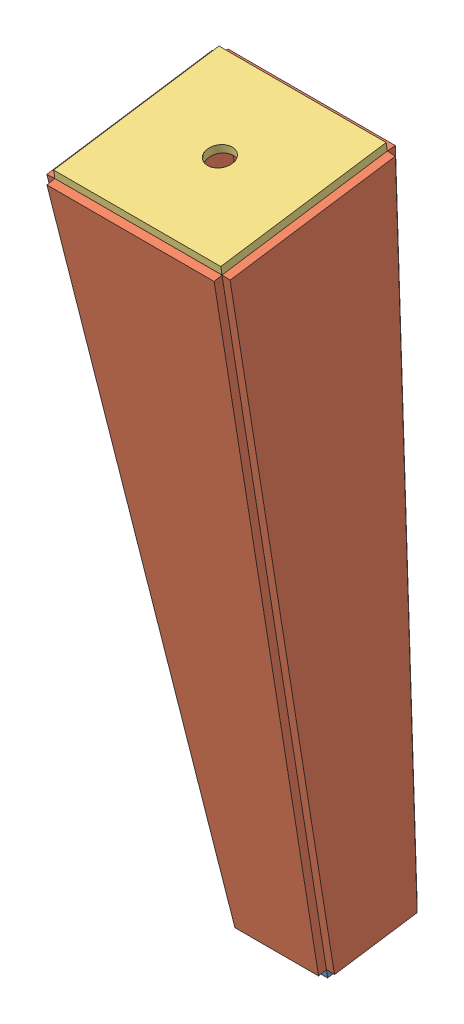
SolidWorks assembly FuselageAssembly.SLDASM, configuration Default (file format 10000). Lengths in mm.
Overall size (27.83 111.81 42.25).
6 component instances, 3 part files, 9 mates.
Components (placement in the parent):
- Fuselage Back Square-2: Fuselage Back Square.SLDPRT [Default] at (-260.7548 -85.8639 404.3783) x (1 0 0) z (0 0.989016 0.147809) size (12.7 12.7 1.22)
- Fuselage Flange-1: Fuselage Flange.SLDPRT [Default] at (-240.4877 21.5831 414.0158) x (0 0.147809 -0.989016) z (0.998268 -0.058177 -0.008695) size (25.4 107.95 1.22)
- Fuselage Flange-2: Fuselage Flange.SLDPRT [Default] at (-241.7048 21.6541 414.0264) x (1 0 0) z (0 -0.089376 0.995998) size (25.4 107.95 1.22)
- Fuselage Flange-3: Fuselage Flange.SLDPRT [Default] at (-241.7048 17.6489 440.3405) x (1 0 0) z (0 -0.205731 0.978609) size (25.4 107.95 1.22)
- Fuselage Flange-4: Fuselage Flange.SLDPRT [Default] at (-268.3219 17.8288 439.1368) x (0 -0.147809 0.989016) z (-0.998268 -0.058177 -0.008695) size (25.4 107.95 1.22)
- Fuselage Front Square-1: Fuselage Front Square.SLDPRT [Default] at (-267.1048 22.8599 414.2066) x (1 0 0) z (0 0.989016 0.147809) size (25.4 25.4 1.22)
Mates (geometry in assembly coordinates):
- Coincident10: coincident aligned: line of Fuselage Flange-2 through (-241.7048 21.6541 414.0264) axis (-1 0 0); line of Fuselage Front Square-1 through (-241.7048 21.6541 414.0264) axis (-1 0 0)
- Coincident11: coincident anti-aligned: line of Fuselage Flange-4 through (-267.1048 17.8997 439.1474) axis (0 0.147809 -0.989016); line of Fuselage Front Square-1 through (-267.1048 21.6541 414.0264) axis (0 -0.147809 0.989016)
- Coincident12: coincident aligned: line of Fuselage Flange-2 through (-267.1048 21.6541 414.0264) axis (0.058722 -0.994279 -0.089222); line of Fuselage Flange-4 through (-267.1048 21.6541 414.0264) axis (0.058722 -0.994279 -0.089222)
- Coincident13: coincident anti-aligned: line of Fuselage Flange-3 through (-241.7048 17.8997 439.1474) axis (-1 0 0); line of Fuselage Front Square-1 through (-267.1048 17.8997 439.1474) axis (1 0 0)
- Coincident14: coincident anti-aligned: line of Fuselage Flange-3 through (-267.1048 17.8997 439.1474) axis (0.058722 -0.97692 -0.205376); line of Fuselage Flange-4 through (-260.7548 -87.7411 416.9388) axis (-0.058722 0.97692 0.205376)
- Coincident15: coincident anti-aligned: line of Fuselage Flange-1 through (-241.7048 21.6541 414.0264) axis (0 -0.147809 0.989016); line of Fuselage Front Square-1 through (-241.7048 17.8997 439.1474) axis (0 0.147809 -0.989016)
- Coincident16: coincident aligned: line of Fuselage Flange-1 through (-248.0548 -85.8639 404.3783) axis (0.058722 0.994279 0.089222); line of Fuselage Flange-2 through (-248.0548 -85.8639 404.3783) axis (0.058722 0.994279 0.089222)
- Coincident17: coincident aligned: line of Fuselage Back Square-2 through (-260.7548 -85.8639 404.3783) axis (0 -0.147809 0.989016); line of Fuselage Flange-4 through (-260.7548 -85.8639 404.3783) axis (0 -0.147809 0.989016)
- Coincident18: coincident anti-aligned: line of Fuselage Back Square-2 through (-248.0548 -85.8639 404.3783) axis (-1 0 0); line of Fuselage Flange-2 through (-260.7548 -85.8639 404.3783) axis (1 0 0)
